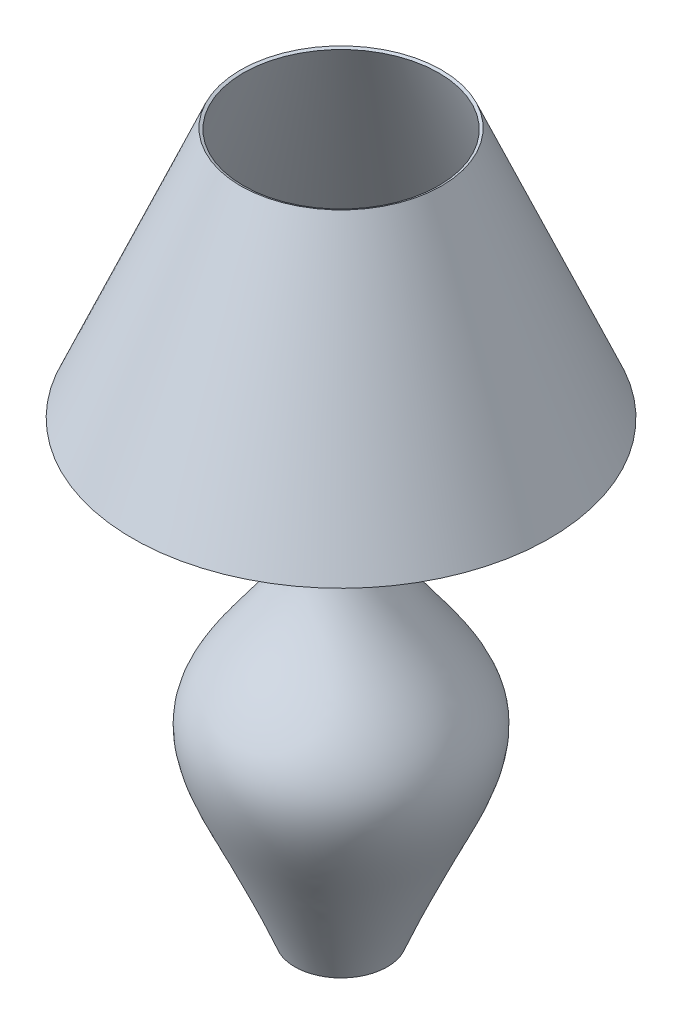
ISO-10303-21;
HEADER;
FILE_DESCRIPTION(('STEP AP214'),'2;1');
FILE_NAME('part.step','',(''),(''),'','','');
FILE_SCHEMA(('AUTOMOTIVE_DESIGN { 1 0 10303 214 1 1 1 1 }'));
ENDSEC;
DATA;
#1=APPLICATION_CONTEXT('core data for automotive mechanical design processes');
#2=APPLICATION_PROTOCOL_DEFINITION('international standard','automotive_design',2000,#1);
#3=PRODUCT_CONTEXT('',#1,'mechanical');
#4=PRODUCT('Part','Part','',(#3));
#5=PRODUCT_RELATED_PRODUCT_CATEGORY('part','',(#4));
#6=PRODUCT_DEFINITION_FORMATION('','',#4);
#7=PRODUCT_DEFINITION_CONTEXT('part definition',#1,'design');
#8=PRODUCT_DEFINITION('design','',#6,#7);
#9=PRODUCT_DEFINITION_SHAPE('','',#8);
#10=(LENGTH_UNIT() NAMED_UNIT(*) SI_UNIT(.MILLI.,.METRE.));
#11=(NAMED_UNIT(*) PLANE_ANGLE_UNIT() SI_UNIT($,.RADIAN.));
#12=(NAMED_UNIT(*) SI_UNIT($,.STERADIAN.) SOLID_ANGLE_UNIT());
#13=UNCERTAINTY_MEASURE_WITH_UNIT(LENGTH_MEASURE(1.E-05),#10,'distance_accuracy_value','');
#14=(GEOMETRIC_REPRESENTATION_CONTEXT(3) GLOBAL_UNCERTAINTY_ASSIGNED_CONTEXT((#13)) GLOBAL_UNIT_ASSIGNED_CONTEXT((#10,
#11,#12)) REPRESENTATION_CONTEXT('',''));
#15=CARTESIAN_POINT('',(0.,0.,0.));
#16=DIRECTION('',(0.,0.,1.));
#17=DIRECTION('',(1.,0.,0.));
#18=AXIS2_PLACEMENT_3D('',#15,#16,#17);
#19=CARTESIAN_POINT('',(1139.91626631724,643.03966613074,0.));
#20=DIRECTION('',(0.,-1.,0.));
#21=DIRECTION('',(0.,0.,-1.));
#22=AXIS2_PLACEMENT_3D('',#19,#20,#21);
#23=CONICAL_SURFACE('',#22,202.944406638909,0.406098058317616);
#24=CARTESIAN_POINT('',(1139.91626631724,888.854582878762,0.));
#25=DIRECTION('',(0.,-1.,0.));
#26=DIRECTION('',(0.,0.,-1.));
#27=AXIS2_PLACEMENT_3D('',#24,#25,#26);
#28=CIRCLE('',#27,97.2439924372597);
#29=CARTESIAN_POINT('',(1139.91626631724,888.854582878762,-97.2439924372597));
#30=VERTEX_POINT('',#29);
#31=EDGE_CURVE('E71',#30,#30,#28,.T.);
#32=ORIENTED_EDGE('',*,*,#31,.F.);
#33=EDGE_LOOP('',(#32));
#34=FACE_BOUND('',#33,.T.);
#35=CARTESIAN_POINT('',(1139.91626631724,643.03966613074,0.));
#36=DIRECTION('',(0.,-1.,0.));
#37=DIRECTION('',(0.,0.,-1.));
#38=AXIS2_PLACEMENT_3D('',#35,#36,#37);
#39=CIRCLE('',#38,202.944406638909);
#40=CARTESIAN_POINT('',(1139.91626631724,643.03966613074,-202.944406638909));
#41=VERTEX_POINT('',#40);
#42=EDGE_CURVE('E10',#41,#41,#39,.T.);
#43=ORIENTED_EDGE('',*,*,#42,.T.);
#44=EDGE_LOOP('',(#43));
#45=FACE_BOUND('',#44,.T.);
#46=ADVANCED_FACE('F31',(#34,#45),#23,.F.);
#47=CARTESIAN_POINT('',(1132.41626631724,643.03966613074,0.));
#48=DIRECTION('',(0.,-1.,0.));
#49=DIRECTION('',(0.,0.,-1.));
#50=AXIS2_PLACEMENT_3D('',#47,#48,#49);
#51=PLANE('',#50);
#52=ORIENTED_EDGE('',*,*,#42,.F.);
#53=EDGE_LOOP('',(#52));
#54=FACE_BOUND('',#53,.T.);
#55=CARTESIAN_POINT('',(1139.91626631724,643.03966613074,0.));
#56=DIRECTION('',(0.,-1.,0.));
#57=DIRECTION('',(0.,0.,-1.));
#58=AXIS2_PLACEMENT_3D('',#55,#56,#57);
#59=CIRCLE('',#58,4.50000000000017);
#60=CARTESIAN_POINT('',(1139.91626631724,643.03966613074,-4.50000000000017));
#61=VERTEX_POINT('',#60);
#62=EDGE_CURVE('E37',#61,#61,#59,.T.);
#63=ORIENTED_EDGE('',*,*,#62,.T.);
#64=EDGE_LOOP('',(#63));
#65=FACE_BOUND('',#64,.T.);
#66=ADVANCED_FACE('F98',(#54,#65),#51,.F.);
#67=CARTESIAN_POINT('',(1139.91626631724,190.03966613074,0.));
#68=DIRECTION('',(0.,-1.,0.));
#69=DIRECTION('',(0.,0.,-1.));
#70=AXIS2_PLACEMENT_3D('',#67,#68,#69);
#71=CYLINDRICAL_SURFACE('',#70,4.50000000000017);
#72=ORIENTED_EDGE('',*,*,#62,.F.);
#73=EDGE_LOOP('',(#72));
#74=FACE_BOUND('',#73,.T.);
#75=CARTESIAN_POINT('',(1139.91626631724,607.03966613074,0.));
#76=DIRECTION('',(0.,-1.,0.));
#77=DIRECTION('',(0.,0.,-1.));
#78=AXIS2_PLACEMENT_3D('',#75,#76,#77);
#79=CIRCLE('',#78,4.50000000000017);
#80=CARTESIAN_POINT('',(1139.91626631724,607.03966613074,-4.50000000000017));
#81=VERTEX_POINT('',#80);
#82=EDGE_CURVE('E41',#81,#81,#79,.T.);
#83=ORIENTED_EDGE('',*,*,#82,.T.);
#84=EDGE_LOOP('',(#83));
#85=FACE_BOUND('',#84,.T.);
#86=ADVANCED_FACE('F95',(#74,#85),#71,.F.);
#87=CARTESIAN_POINT('',(1112.41626631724,607.03966613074,0.));
#88=DIRECTION('',(0.,1.,0.));
#89=DIRECTION('',(0.,0.,1.));
#90=AXIS2_PLACEMENT_3D('',#87,#88,#89);
#91=PLANE('',#90);
#92=ORIENTED_EDGE('',*,*,#82,.F.);
#93=EDGE_LOOP('',(#92));
#94=FACE_BOUND('',#93,.T.);
#95=CARTESIAN_POINT('',(1139.91626631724,607.039666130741,0.));
#96=DIRECTION('',(0.,-1.,0.));
#97=DIRECTION('',(0.,0.,-1.));
#98=AXIS2_PLACEMENT_3D('',#95,#96,#97);
#99=CIRCLE('',#98,24.5617886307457);
#100=CARTESIAN_POINT('',(1139.91626631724,607.039666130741,-24.5617886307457));
#101=VERTEX_POINT('',#100);
#102=EDGE_CURVE('E45',#101,#101,#99,.T.);
#103=ORIENTED_EDGE('',*,*,#102,.T.);
#104=EDGE_LOOP('',(#103));
#105=FACE_BOUND('',#104,.T.);
#106=ADVANCED_FACE('F90',(#94,#105),#91,.F.);
#107=CARTESIAN_POINT('',(1095.96640618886,193.03966613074,0.));
#108=CARTESIAN_POINT('',(1090.23918898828,207.660102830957,0.));
#109=CARTESIAN_POINT('',(1083.11695588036,224.36367198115,0.));
#110=CARTESIAN_POINT('',(1071.29269486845,250.876854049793,0.));
#111=CARTESIAN_POINT('',(1067.16124631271,259.95701195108,0.));
#112=CARTESIAN_POINT('',(1060.7986655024,273.729843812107,0.));
#113=CARTESIAN_POINT('',(1058.65023990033,278.346211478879,0.));
#114=CARTESIAN_POINT('',(1055.40122652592,285.282457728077,0.));
#115=CARTESIAN_POINT('',(1054.3138263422,287.596488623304,0.));
#116=CARTESIAN_POINT('',(1052.13273112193,292.22403797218,0.));
#117=CARTESIAN_POINT('',(1051.03894069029,294.536339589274,0.));
#118=CARTESIAN_POINT('',(1045.59157677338,306.078789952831,0.));
#119=CARTESIAN_POINT('',(1041.30126655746,315.260568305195,0.));
#120=CARTESIAN_POINT('',(1033.76647547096,333.403430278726,0.));
#121=CARTESIAN_POINT('',(1030.52322825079,342.364123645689,0.));
#122=CARTESIAN_POINT('',(1027.10697440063,355.532768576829,0.));
#123=CARTESIAN_POINT('',(1026.20930927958,359.876666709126,0.));
#124=CARTESIAN_POINT('',(1025.00006533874,368.456813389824,0.));
#125=CARTESIAN_POINT('',(1024.68840016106,372.692812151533,0.));
#126=CARTESIAN_POINT('',(1024.73478612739,378.959266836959,0.));
#127=CARTESIAN_POINT('',(1024.8358635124,381.033582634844,0.));
#128=CARTESIAN_POINT('',(1025.22168297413,385.153434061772,0.));
#129=CARTESIAN_POINT('',(1025.50786541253,387.197041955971,0.));
#130=CARTESIAN_POINT('',(1026.64969021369,393.314694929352,0.));
#131=CARTESIAN_POINT('',(1027.78108344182,397.369609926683,0.));
#132=CARTESIAN_POINT('',(1032.11317083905,409.490002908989,0.));
#133=CARTESIAN_POINT('',(1036.25538383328,417.510348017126,0.));
#134=CARTESIAN_POINT('',(1046.03955124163,433.492284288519,0.));
#135=CARTESIAN_POINT('',(1051.67872044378,441.452045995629,0.));
#136=CARTESIAN_POINT('',(1063.38481932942,457.396506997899,0.));
#137=CARTESIAN_POINT('',(1069.45171863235,465.382904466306,0.));
#138=CARTESIAN_POINT('',(1080.93458172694,481.503201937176,0.));
#139=CARTESIAN_POINT('',(1086.35295211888,489.624425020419,0.));
#140=CARTESIAN_POINT('',(1096.05478262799,506.18448251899,0.));
#141=CARTESIAN_POINT('',(1100.33856630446,514.623973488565,0.));
#142=CARTESIAN_POINT('',(1105.53359475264,527.666397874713,0.));
#143=CARTESIAN_POINT('',(1107.05997150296,532.077649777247,0.));
#144=CARTESIAN_POINT('',(1108.99272699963,538.806258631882,0.));
#145=CARTESIAN_POINT('',(1109.57586816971,541.068166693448,0.));
#146=CARTESIAN_POINT('',(1110.62484782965,545.61624457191,0.));
#147=CARTESIAN_POINT('',(1111.09192387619,547.903706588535,0.));
#148=CARTESIAN_POINT('',(1113.17523671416,559.40081240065,0.));
#149=CARTESIAN_POINT('',(1114.03642484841,568.788639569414,0.));
#150=CARTESIAN_POINT('',(1115.02951243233,587.785079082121,0.));
#151=CARTESIAN_POINT('',(1115.16124594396,597.394772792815,0.));
#152=CARTESIAN_POINT('',(1115.35447768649,607.039666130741,0.));
#153=B_SPLINE_CURVE_WITH_KNOTS('',3,(#107,#108,#109,#110,#111,#112,#113,#114,#115,#116,#117,
#118,#119,#120,#121,#122,#123,#124,#125,#126,#127,#128,#129,#130,#131,#132,#133,#134,#135,#136,
#137,#138,#139,#140,#141,#142,#143,#144,#145,#146,#147,#148,#149,#150,#151,#152),.UNSPECIFIED.,
.F.,.F.,(4,2,2,2,2,2,2,2,2,2,2,2,2,2,2,2,2,2,2,2,2,2,4),(0.,0.124999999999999,0.187499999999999,
0.218749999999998,0.234374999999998,0.249999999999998,0.312499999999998,0.374999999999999,
0.406249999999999,0.437499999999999,0.453124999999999,0.468749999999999,0.499999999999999,
0.562499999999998,0.624999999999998,0.687499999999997,0.749999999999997,0.812499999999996,
0.843749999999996,0.859374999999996,0.874999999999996,0.937499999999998,1.),.UNSPECIFIED.);
#154=CARTESIAN_POINT('',(1139.91626631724,190.03966613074,0.));
#155=DIRECTION('',(0.,-1.,0.));
#156=AXIS1_PLACEMENT('',#154,#155);
#157=SURFACE_OF_REVOLUTION('',#153,#156);
#158=ORIENTED_EDGE('',*,*,#102,.F.);
#159=EDGE_LOOP('',(#158));
#160=FACE_BOUND('',#159,.T.);
#161=CARTESIAN_POINT('',(1139.91626631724,193.03966613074,0.));
#162=DIRECTION('',(0.,-1.,0.));
#163=DIRECTION('',(0.,0.,-1.));
#164=AXIS2_PLACEMENT_3D('',#161,#162,#163);
#165=CIRCLE('',#164,43.9498601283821);
#166=CARTESIAN_POINT('',(1139.91626631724,193.03966613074,-43.9498601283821));
#167=VERTEX_POINT('',#166);
#168=EDGE_CURVE('E50',#167,#167,#165,.T.);
#169=ORIENTED_EDGE('',*,*,#168,.T.);
#170=EDGE_LOOP('',(#169));
#171=FACE_BOUND('',#170,.T.);
#172=ADVANCED_FACE('F85',(#160,#171),#157,.T.);
#173=CARTESIAN_POINT('',(1139.91626631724,193.03966613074,0.));
#174=DIRECTION('',(0.,-1.,0.));
#175=DIRECTION('',(0.,0.,-1.));
#176=AXIS2_PLACEMENT_3D('',#173,#174,#175);
#177=PLANE('',#176);
#178=ORIENTED_EDGE('',*,*,#168,.F.);
#179=EDGE_LOOP('',(#178));
#180=FACE_BOUND('',#179,.T.);
#181=ADVANCED_FACE('F89',(#180),#177,.F.);
#182=CARTESIAN_POINT('',(1139.91626631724,190.03966613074,0.));
#183=DIRECTION('',(0.,-1.,0.));
#184=DIRECTION('',(0.,0.,-1.));
#185=AXIS2_PLACEMENT_3D('',#182,#183,#184);
#186=PLANE('',#185);
#187=CARTESIAN_POINT('',(1139.91626631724,190.03966613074,0.));
#188=DIRECTION('',(0.,-1.,0.));
#189=DIRECTION('',(0.,0.,-1.));
#190=AXIS2_PLACEMENT_3D('',#187,#188,#189);
#191=CIRCLE('',#190,46.);
#192=CARTESIAN_POINT('',(1139.91626631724,190.03966613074,-46.));
#193=VERTEX_POINT('',#192);
#194=EDGE_CURVE('E53',#193,#193,#191,.T.);
#195=ORIENTED_EDGE('',*,*,#194,.T.);
#196=EDGE_LOOP('',(#195));
#197=FACE_BOUND('',#196,.T.);
#198=ADVANCED_FACE('F143',(#197),#186,.T.);
#199=CARTESIAN_POINT('',(1093.91626631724,190.03966613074,0.));
#200=CARTESIAN_POINT('',(1083.11809541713,217.857659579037,0.));
#201=CARTESIAN_POINT('',(1051.95848474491,287.086557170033,0.));
#202=CARTESIAN_POINT('',(1001.90064988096,388.85361081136,0.));
#203=CARTESIAN_POINT('',(1069.57388241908,466.143983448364,0.));
#204=CARTESIAN_POINT('',(1112.1546126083,536.795861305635,0.));
#205=CARTESIAN_POINT('',(1111.88695011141,585.691120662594,0.));
#206=CARTESIAN_POINT('',(1112.41626631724,610.03966613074,0.));
#207=B_SPLINE_CURVE_WITH_KNOTS('',3,(#199,#200,#201,#202,#203,#204,#205,#206),.UNSPECIFIED.,.F.,
.F.,(4,1,1,1,1,4),(0.,0.239172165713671,0.460966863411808,0.681915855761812,0.844506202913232,
1.),.UNSPECIFIED.);
#208=CARTESIAN_POINT('',(1139.91626631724,190.03966613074,0.));
#209=DIRECTION('',(0.,-1.,0.));
#210=AXIS1_PLACEMENT('',#208,#209);
#211=SURFACE_OF_REVOLUTION('',#207,#210);
#212=CARTESIAN_POINT('',(1139.91626631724,610.03966613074,0.));
#213=DIRECTION('',(0.,-1.,0.));
#214=DIRECTION('',(0.,0.,-1.));
#215=AXIS2_PLACEMENT_3D('',#212,#213,#214);
#216=CIRCLE('',#215,27.5000000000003);
#217=CARTESIAN_POINT('',(1139.91626631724,610.03966613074,-27.5000000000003));
#218=VERTEX_POINT('',#217);
#219=EDGE_CURVE('E56',#218,#218,#216,.T.);
#220=ORIENTED_EDGE('',*,*,#219,.T.);
#221=EDGE_LOOP('',(#220));
#222=FACE_BOUND('',#221,.T.);
#223=ORIENTED_EDGE('',*,*,#194,.F.);
#224=EDGE_LOOP('',(#223));
#225=FACE_BOUND('',#224,.T.);
#226=ADVANCED_FACE('F137',(#222,#225),#211,.F.);
#227=CARTESIAN_POINT('',(1112.41626631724,610.03966613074,0.));
#228=DIRECTION('',(0.,1.,0.));
#229=DIRECTION('',(0.,0.,1.));
#230=AXIS2_PLACEMENT_3D('',#227,#228,#229);
#231=PLANE('',#230);
#232=CARTESIAN_POINT('',(1139.91626631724,610.03966613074,0.));
#233=DIRECTION('',(0.,-1.,0.));
#234=DIRECTION('',(0.,0.,-1.));
#235=AXIS2_PLACEMENT_3D('',#232,#233,#234);
#236=CIRCLE('',#235,7.50000000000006);
#237=CARTESIAN_POINT('',(1139.91626631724,610.03966613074,-7.50000000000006));
#238=VERTEX_POINT('',#237);
#239=EDGE_CURVE('E59',#238,#238,#236,.T.);
#240=ORIENTED_EDGE('',*,*,#239,.T.);
#241=EDGE_LOOP('',(#240));
#242=FACE_BOUND('',#241,.T.);
#243=ORIENTED_EDGE('',*,*,#219,.F.);
#244=EDGE_LOOP('',(#243));
#245=FACE_BOUND('',#244,.T.);
#246=ADVANCED_FACE('F131',(#242,#245),#231,.T.);
#247=CARTESIAN_POINT('',(1139.91626631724,190.03966613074,0.));
#248=DIRECTION('',(0.,-1.,0.));
#249=DIRECTION('',(0.,0.,-1.));
#250=AXIS2_PLACEMENT_3D('',#247,#248,#249);
#251=CYLINDRICAL_SURFACE('',#250,7.50000000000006);
#252=CARTESIAN_POINT('',(1139.91626631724,640.03966613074,0.));
#253=DIRECTION('',(0.,-1.,0.));
#254=DIRECTION('',(0.,0.,-1.));
#255=AXIS2_PLACEMENT_3D('',#252,#253,#254);
#256=CIRCLE('',#255,7.50000000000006);
#257=CARTESIAN_POINT('',(1139.91626631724,640.03966613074,-7.50000000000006));
#258=VERTEX_POINT('',#257);
#259=EDGE_CURVE('E62',#258,#258,#256,.T.);
#260=ORIENTED_EDGE('',*,*,#259,.T.);
#261=EDGE_LOOP('',(#260));
#262=FACE_BOUND('',#261,.T.);
#263=ORIENTED_EDGE('',*,*,#239,.F.);
#264=EDGE_LOOP('',(#263));
#265=FACE_BOUND('',#264,.T.);
#266=ADVANCED_FACE('F125',(#262,#265),#251,.T.);
#267=CARTESIAN_POINT('',(1132.41626631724,640.03966613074,0.));
#268=DIRECTION('',(0.,-1.,0.));
#269=DIRECTION('',(0.,0.,-1.));
#270=AXIS2_PLACEMENT_3D('',#267,#268,#269);
#271=PLANE('',#270);
#272=CARTESIAN_POINT('',(1139.91626631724,640.03966613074,0.));
#273=DIRECTION('',(0.,-1.,0.));
#274=DIRECTION('',(0.,0.,-1.));
#275=AXIS2_PLACEMENT_3D('',#272,#273,#274);
#276=CIRCLE('',#275,207.5);
#277=CARTESIAN_POINT('',(1139.91626631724,640.03966613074,-207.5));
#278=VERTEX_POINT('',#277);
#279=EDGE_CURVE('E65',#278,#278,#276,.T.);
#280=ORIENTED_EDGE('',*,*,#279,.T.);
#281=EDGE_LOOP('',(#280));
#282=FACE_BOUND('',#281,.T.);
#283=ORIENTED_EDGE('',*,*,#259,.F.);
#284=EDGE_LOOP('',(#283));
#285=FACE_BOUND('',#284,.T.);
#286=ADVANCED_FACE('F119',(#282,#285),#271,.T.);
#287=CARTESIAN_POINT('',(1139.91626631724,640.03966613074,0.));
#288=DIRECTION('',(0.,-1.,0.));
#289=DIRECTION('',(0.,0.,-1.));
#290=AXIS2_PLACEMENT_3D('',#287,#288,#289);
#291=CONICAL_SURFACE('',#290,207.5,0.406098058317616);
#292=CARTESIAN_POINT('',(1139.91626631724,890.03966613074,0.));
#293=DIRECTION('',(0.,-1.,0.));
#294=DIRECTION('',(0.,0.,-1.));
#295=AXIS2_PLACEMENT_3D('',#292,#293,#294);
#296=CIRCLE('',#295,99.9999999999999);
#297=CARTESIAN_POINT('',(1139.91626631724,890.03966613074,-99.9999999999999));
#298=VERTEX_POINT('',#297);
#299=EDGE_CURVE('E68',#298,#298,#296,.T.);
#300=ORIENTED_EDGE('',*,*,#299,.T.);
#301=EDGE_LOOP('',(#300));
#302=FACE_BOUND('',#301,.T.);
#303=ORIENTED_EDGE('',*,*,#279,.F.);
#304=EDGE_LOOP('',(#303));
#305=FACE_BOUND('',#304,.T.);
#306=ADVANCED_FACE('F113',(#302,#305),#291,.T.);
#307=CARTESIAN_POINT('',(1139.91626631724,890.03966613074,0.));
#308=DIRECTION('',(0.,1.,0.));
#309=DIRECTION('',(0.,0.,1.));
#310=AXIS2_PLACEMENT_3D('',#307,#308,#309);
#311=CONICAL_SURFACE('',#310,99.9999999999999,1.16469826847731);
#312=ORIENTED_EDGE('',*,*,#31,.T.);
#313=EDGE_LOOP('',(#312));
#314=FACE_BOUND('',#313,.T.);
#315=ORIENTED_EDGE('',*,*,#299,.F.);
#316=EDGE_LOOP('',(#315));
#317=FACE_BOUND('',#316,.T.);
#318=ADVANCED_FACE('F110',(#314,#317),#311,.F.);
#319=CLOSED_SHELL('',(#46,#66,#86,#106,#172,#181,#198,#226,#246,#266,#286,#306,#318));
#320=MANIFOLD_SOLID_BREP('B2',#319);
#321=ADVANCED_BREP_SHAPE_REPRESENTATION('',(#18,#320),#14);
#322=SHAPE_DEFINITION_REPRESENTATION(#9,#321);
ENDSEC;
END-ISO-10303-21;
